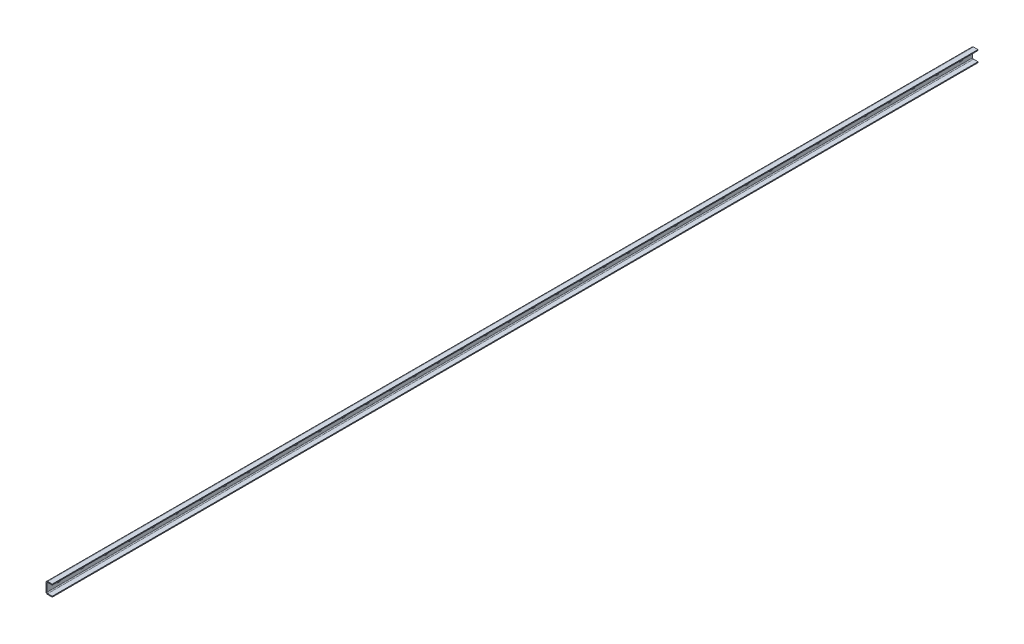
from build123d import *

# Parameters (mm, degrees)
BOSS_EXTRUDE1_DEPTH = 3120
CUT_EXTRUDE1_DEPTH  = 3121.111306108
LPATTERN1_COUNT     = 39
LPATTERN1_PITCH     = 80


with BuildPart() as part:
    # Sketch1 → Boss-Extrude1 (new body)
    with BuildSketch(Plane.XY):
        with BuildLine():
            Line((21, 16.25), (21, 19.25))
            Line((21, 19.25), (6, 19.25))
            ThreePointArc((6, 19.25), (1.757359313, 17.492640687), (0, 13.25))
            Line((0, 13.25), (0, 0))
            Line((0, 0), (0, -13.25))
            ThreePointArc((0, -13.25), (1.757359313, -17.492640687), (6, -19.25))
            Line((6, -19.25), (21, -19.25))
            Line((21, -19.25), (21, -16.25))
            Line((21, -16.25), (6, -16.25))
            ThreePointArc((6, -16.25), (3.878679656, -15.371320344), (3, -13.25))
            Line((3, -13.25), (3, 13.25))
            ThreePointArc((3, 13.25), (3.878679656, 15.371320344), (6, 16.25))
            Line((6, 16.25), (21, 16.25))
        make_face()
    extrude(amount=-BOSS_EXTRUDE1_DEPTH)

    # Sketch2 → Cut-Extrude1 (cut, through all)
    with BuildSketch(Plane(origin=(3, 0, 0), x_dir=(0, 0, -1), z_dir=(1, 0, 0))):
        with BuildLine():
            Line((38, 4.5), (42, 4.5))
            ThreePointArc((42, 4.5), (46.5, 0), (42, -4.5))
            Line((42, -4.5), (38, -4.5))
            ThreePointArc((38, -4.5), (33.5, 0), (38, 4.5))
        make_face()
    cut_extrude1 = extrude(amount=-CUT_EXTRUDE1_DEPTH, mode=Mode.SUBTRACT)

    # LPattern1: Cut-Extrude1 ×39
    with Locations(*[(0, 0, -i * LPATTERN1_PITCH) for i in range(1, LPATTERN1_COUNT)]):
        add(cut_extrude1, mode=Mode.SUBTRACT)


solid = part.part
